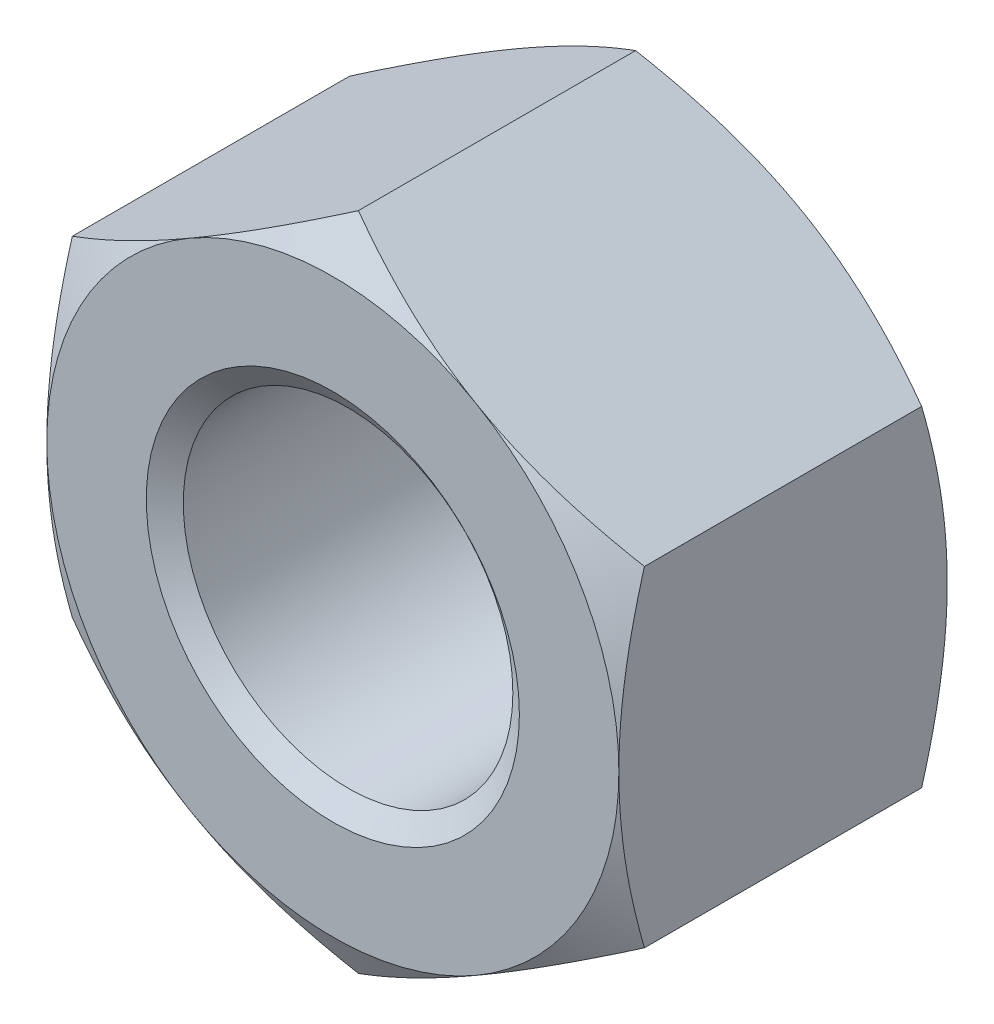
ISO-10303-21;
HEADER;
FILE_DESCRIPTION(('STEP AP214'),'2;1');
FILE_NAME('part.step','',(''),(''),'','','');
FILE_SCHEMA(('AUTOMOTIVE_DESIGN { 1 0 10303 214 1 1 1 1 }'));
ENDSEC;
DATA;
#1=APPLICATION_CONTEXT('core data for automotive mechanical design processes');
#2=APPLICATION_PROTOCOL_DEFINITION('international standard','automotive_design',2000,#1);
#3=PRODUCT_CONTEXT('',#1,'mechanical');
#4=PRODUCT('Part','Part','',(#3));
#5=PRODUCT_RELATED_PRODUCT_CATEGORY('part','',(#4));
#6=PRODUCT_DEFINITION_FORMATION('','',#4);
#7=PRODUCT_DEFINITION_CONTEXT('part definition',#1,'design');
#8=PRODUCT_DEFINITION('design','',#6,#7);
#9=PRODUCT_DEFINITION_SHAPE('','',#8);
#10=(LENGTH_UNIT() NAMED_UNIT(*) SI_UNIT(.MILLI.,.METRE.));
#11=(NAMED_UNIT(*) PLANE_ANGLE_UNIT() SI_UNIT($,.RADIAN.));
#12=(NAMED_UNIT(*) SI_UNIT($,.STERADIAN.) SOLID_ANGLE_UNIT());
#13=UNCERTAINTY_MEASURE_WITH_UNIT(LENGTH_MEASURE(1.E-05),#10,'distance_accuracy_value','');
#14=(GEOMETRIC_REPRESENTATION_CONTEXT(3) GLOBAL_UNCERTAINTY_ASSIGNED_CONTEXT((#13)) GLOBAL_UNIT_ASSIGNED_CONTEXT((#10,
#11,#12)) REPRESENTATION_CONTEXT('',''));
#15=CARTESIAN_POINT('',(0.,0.,0.));
#16=DIRECTION('',(0.,0.,1.));
#17=DIRECTION('',(1.,0.,0.));
#18=AXIS2_PLACEMENT_3D('',#15,#16,#17);
#19=CARTESIAN_POINT('',(0.,0.,-26.4));
#20=DIRECTION('',(0.,0.,1.));
#21=DIRECTION('',(1.,0.,0.));
#22=AXIS2_PLACEMENT_3D('',#19,#20,#21);
#23=CYLINDRICAL_SURFACE('',#22,13.25);
#24=CARTESIAN_POINT('',(0.,0.,-1.22536319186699));
#25=DIRECTION('',(0.,0.,1.));
#26=DIRECTION('',(1.,0.,0.));
#27=AXIS2_PLACEMENT_3D('',#24,#25,#26);
#28=CIRCLE('',#27,13.25);
#29=CARTESIAN_POINT('',(13.25,0.,-1.22536319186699));
#30=VERTEX_POINT('',#29);
#31=EDGE_CURVE('E174',#30,#30,#28,.F.);
#32=ORIENTED_EDGE('',*,*,#31,.F.);
#33=EDGE_LOOP('',(#32));
#34=FACE_BOUND('',#33,.T.);
#35=CARTESIAN_POINT('',(0.,0.,-25.149236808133));
#36=DIRECTION('',(0.,0.,-1.));
#37=DIRECTION('',(-1.,0.,0.));
#38=AXIS2_PLACEMENT_3D('',#35,#36,#37);
#39=CIRCLE('',#38,13.25);
#40=CARTESIAN_POINT('',(-13.25,0.,-25.149236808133));
#41=VERTEX_POINT('',#40);
#42=EDGE_CURVE('E39',#41,#41,#39,.F.);
#43=ORIENTED_EDGE('',*,*,#42,.F.);
#44=EDGE_LOOP('',(#43));
#45=FACE_BOUND('',#44,.T.);
#46=ADVANCED_FACE('F34',(#34,#45),#23,.F.);
#47=CARTESIAN_POINT('',(0.,26.5581123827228,-26.4));
#48=DIRECTION('',(-0.500000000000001,0.866025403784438,0.));
#49=DIRECTION('',(-0.866025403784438,-0.500000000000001,0.));
#50=AXIS2_PLACEMENT_3D('',#47,#48,#49);
#51=PLANE('',#50);
#52=DIRECTION('',(0.,0.,1.));
#53=VECTOR('',#52,1.);
#54=CARTESIAN_POINT('',(-23.,13.2790561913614,-26.4));
#55=LINE('',#54,#53);
#56=CARTESIAN_POINT('',(-23.,13.2790561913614,-24.345722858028));
#57=VERTEX_POINT('',#56);
#58=CARTESIAN_POINT('',(-23.,13.2790561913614,-2.05427714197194));
#59=VERTEX_POINT('',#58);
#60=EDGE_CURVE('E164',#57,#59,#55,.T.);
#61=ORIENTED_EDGE('',*,*,#60,.T.);
#62=CARTESIAN_POINT('',(-23.0002,13.2789407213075,-2.05434380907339));
#63=CARTESIAN_POINT('',(-22.4946699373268,13.5708086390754,-1.88584599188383));
#64=CARTESIAN_POINT('',(-21.9871680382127,13.8638149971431,-1.72499439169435));
#65=CARTESIAN_POINT('',(-20.9680946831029,14.4521772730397,-1.42070899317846));
#66=CARTESIAN_POINT('',(-20.4565219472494,14.7475339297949,-1.27728092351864));
#67=CARTESIAN_POINT('',(-19.4283073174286,15.3411739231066,-1.00976772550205));
#68=CARTESIAN_POINT('',(-18.9116563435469,15.6394625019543,-0.885728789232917));
#69=CARTESIAN_POINT('',(-17.874786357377,16.2380996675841,-0.659665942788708));
#70=CARTESIAN_POINT('',(-17.3545677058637,16.5384480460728,-0.557639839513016));
#71=CARTESIAN_POINT('',(-16.3238595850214,17.133527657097,-0.379933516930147));
#72=CARTESIAN_POINT('',(-15.8134465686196,17.4282147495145,-0.303665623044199));
#73=CARTESIAN_POINT('',(-14.7902817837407,18.0189392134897,-0.175781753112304));
#74=CARTESIAN_POINT('',(-14.2775299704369,18.3149766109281,-0.12416625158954));
#75=CARTESIAN_POINT('',(-13.2511650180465,18.9075486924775,-0.046890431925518));
#76=CARTESIAN_POINT('',(-12.737553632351,19.2040823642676,-0.021199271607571));
#77=CARTESIAN_POINT('',(-11.709856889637,19.7974233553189,0.00367538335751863));
#78=CARTESIAN_POINT('',(-11.1957715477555,20.0942306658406,0.00285969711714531));
#79=CARTESIAN_POINT('',(-10.2346805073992,20.649116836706,-0.0234279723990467));
#80=CARTESIAN_POINT('',(-9.78760635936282,20.9072352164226,-0.0456944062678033));
#81=CARTESIAN_POINT('',(-8.89452539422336,21.422855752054,-0.109851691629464));
#82=CARTESIAN_POINT('',(-8.448518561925,21.6803579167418,-0.151742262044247));
#83=CARTESIAN_POINT('',(-7.55773701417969,22.1946508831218,-0.254421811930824));
#84=CARTESIAN_POINT('',(-7.11296378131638,22.4514408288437,-0.315227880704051));
#85=CARTESIAN_POINT('',(-6.22554696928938,22.9637911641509,-0.454662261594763));
#86=CARTESIAN_POINT('',(-5.78290338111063,23.219351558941,-0.533290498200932));
#87=CARTESIAN_POINT('',(-4.43913170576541,23.9951784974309,-0.797926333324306));
#88=CARTESIAN_POINT('',(-3.54182151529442,24.513240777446,-1.01033549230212));
#89=CARTESIAN_POINT('',(-2.20576568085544,25.2846129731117,-1.37195212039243));
#90=CARTESIAN_POINT('',(-1.76244815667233,25.5405624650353,-1.49952801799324));
#91=CARTESIAN_POINT('',(-0.878879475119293,26.0506910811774,-1.76759530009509));
#92=CARTESIAN_POINT('',(-0.438627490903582,26.3048706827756,-1.90808304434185));
#93=CARTESIAN_POINT('',(0.000200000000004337,26.5582278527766,-2.05434380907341));
#94=B_SPLINE_CURVE_WITH_KNOTS('',3,(#62,#63,#64,#65,#66,#67,#68,#69,#70,#71,#72,#73,#74,#75,#76,
#77,#78,#79,#80,#81,#82,#83,#84,#85,#86,#87,#88,#89,#90,#91,#92,#93),.UNSPECIFIED.,.F.,.F.,(4,2,
2,2,2,2,2,2,2,2,2,2,2,2,2,4),(0.,1.82275209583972,3.64610187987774,5.47373144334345,
7.3011788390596,9.08355891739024,10.8659733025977,12.6462646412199,14.4265009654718,
15.9762768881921,17.5260306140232,19.0771885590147,20.6283399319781,23.7989683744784,
25.381520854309,26.9636285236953),.UNSPECIFIED.);
#95=CARTESIAN_POINT('',(-11.5,19.9185842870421,0.));
#96=VERTEX_POINT('',#95);
#97=EDGE_CURVE('E133',#59,#96,#94,.T.);
#98=ORIENTED_EDGE('',*,*,#97,.T.);
#99=CARTESIAN_POINT('',(0.,26.5581123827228,-2.05427714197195));
#100=VERTEX_POINT('',#99);
#101=EDGE_CURVE('E53',#96,#100,#94,.T.);
#102=ORIENTED_EDGE('',*,*,#101,.T.);
#103=DIRECTION('',(0.,0.,1.));
#104=VECTOR('',#103,1.);
#105=CARTESIAN_POINT('',(0.,26.5581123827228,-26.4));
#106=LINE('',#105,#104);
#107=CARTESIAN_POINT('',(0.,26.5581123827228,-24.345722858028));
#108=VERTEX_POINT('',#107);
#109=EDGE_CURVE('E149',#108,#100,#106,.T.);
#110=ORIENTED_EDGE('',*,*,#109,.F.);
#111=CARTESIAN_POINT('',(-23.0002,13.2789407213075,-24.3456561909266));
#112=CARTESIAN_POINT('',(-22.4946699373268,13.5708086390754,-24.5141540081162));
#113=CARTESIAN_POINT('',(-21.9871680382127,13.8638149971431,-24.6750056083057));
#114=CARTESIAN_POINT('',(-20.9680946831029,14.4521772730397,-24.9792910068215));
#115=CARTESIAN_POINT('',(-20.4565219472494,14.7475339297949,-25.1227190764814));
#116=CARTESIAN_POINT('',(-19.4283073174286,15.3411739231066,-25.3902322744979));
#117=CARTESIAN_POINT('',(-18.9116563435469,15.6394625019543,-25.5142712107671));
#118=CARTESIAN_POINT('',(-17.874786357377,16.2380996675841,-25.7403340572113));
#119=CARTESIAN_POINT('',(-17.3545677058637,16.5384480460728,-25.842360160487));
#120=CARTESIAN_POINT('',(-16.3238595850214,17.133527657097,-26.0200664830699));
#121=CARTESIAN_POINT('',(-15.8134465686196,17.4282147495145,-26.0963343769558));
#122=CARTESIAN_POINT('',(-14.7902817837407,18.0189392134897,-26.2242182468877));
#123=CARTESIAN_POINT('',(-14.2775299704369,18.3149766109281,-26.2758337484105));
#124=CARTESIAN_POINT('',(-13.2511650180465,18.9075486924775,-26.3531095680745));
#125=CARTESIAN_POINT('',(-12.737553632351,19.2040823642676,-26.3788007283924));
#126=CARTESIAN_POINT('',(-11.709856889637,19.7974233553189,-26.4036753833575));
#127=CARTESIAN_POINT('',(-11.1957715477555,20.0942306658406,-26.4028596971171));
#128=CARTESIAN_POINT('',(-10.2346805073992,20.649116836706,-26.376572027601));
#129=CARTESIAN_POINT('',(-9.78760635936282,20.9072352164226,-26.3543055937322));
#130=CARTESIAN_POINT('',(-8.89452539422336,21.422855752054,-26.2901483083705));
#131=CARTESIAN_POINT('',(-8.448518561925,21.6803579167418,-26.2482577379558));
#132=CARTESIAN_POINT('',(-7.55773701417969,22.1946508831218,-26.1455781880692));
#133=CARTESIAN_POINT('',(-7.11296378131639,22.4514408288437,-26.084772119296));
#134=CARTESIAN_POINT('',(-6.22554696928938,22.9637911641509,-25.9453377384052));
#135=CARTESIAN_POINT('',(-5.78290338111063,23.219351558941,-25.8667095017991));
#136=CARTESIAN_POINT('',(-4.43913170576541,23.9951784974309,-25.6020736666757));
#137=CARTESIAN_POINT('',(-3.54182151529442,24.513240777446,-25.3896645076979));
#138=CARTESIAN_POINT('',(-2.20576568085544,25.2846129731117,-25.0280478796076));
#139=CARTESIAN_POINT('',(-1.76244815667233,25.5405624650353,-24.9004719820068));
#140=CARTESIAN_POINT('',(-0.878879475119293,26.0506910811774,-24.6324046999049));
#141=CARTESIAN_POINT('',(-0.438627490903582,26.3048706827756,-24.4919169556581));
#142=CARTESIAN_POINT('',(0.000200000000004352,26.5582278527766,-24.3456561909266));
#143=B_SPLINE_CURVE_WITH_KNOTS('',3,(#111,#112,#113,#114,#115,#116,#117,#118,#119,#120,#121,
#122,#123,#124,#125,#126,#127,#128,#129,#130,#131,#132,#133,#134,#135,#136,#137,#138,#139,#140,
#141,#142),.UNSPECIFIED.,.F.,.F.,(4,2,2,2,2,2,2,2,2,2,2,2,2,2,2,4),(0.,1.82275209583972,
3.64610187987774,5.47373144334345,7.3011788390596,9.08355891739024,10.8659733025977,
12.6462646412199,14.4265009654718,15.9762768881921,17.5260306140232,19.0771885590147,
20.6283399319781,23.7989683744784,25.381520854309,26.9636285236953),.UNSPECIFIED.);
#144=CARTESIAN_POINT('',(-11.5,19.9185842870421,-26.4));
#145=VERTEX_POINT('',#144);
#146=EDGE_CURVE('E167',#145,#108,#143,.T.);
#147=ORIENTED_EDGE('',*,*,#146,.F.);
#148=EDGE_CURVE('E259',#57,#145,#143,.T.);
#149=ORIENTED_EDGE('',*,*,#148,.F.);
#150=EDGE_LOOP('',(#61,#98,#102,#110,#147,#149));
#151=FACE_BOUND('',#150,.T.);
#152=ADVANCED_FACE('F36',(#151),#51,.T.);
#153=CARTESIAN_POINT('',(23.,13.2790561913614,-26.4));
#154=DIRECTION('',(0.500000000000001,0.866025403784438,0.));
#155=DIRECTION('',(-0.866025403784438,0.500000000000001,0.));
#156=AXIS2_PLACEMENT_3D('',#153,#154,#155);
#157=PLANE('',#156);
#158=ORIENTED_EDGE('',*,*,#109,.T.);
#159=CARTESIAN_POINT('',(-0.000199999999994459,26.5582278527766,-2.05434380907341));
#160=CARTESIAN_POINT('',(0.505330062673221,26.2663599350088,-1.88584599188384));
#161=CARTESIAN_POINT('',(1.01283196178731,25.973353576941,-1.72499439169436));
#162=CARTESIAN_POINT('',(2.03190531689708,25.3849913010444,-1.42070899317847));
#163=CARTESIAN_POINT('',(2.54347805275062,25.0896346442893,-1.27728092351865));
#164=CARTESIAN_POINT('',(3.57169268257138,24.4959946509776,-1.00976772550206));
#165=CARTESIAN_POINT('',(4.08834365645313,24.1977060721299,-0.885728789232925));
#166=CARTESIAN_POINT('',(5.12521364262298,23.5990689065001,-0.659665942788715));
#167=CARTESIAN_POINT('',(5.64543229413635,23.2987205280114,-0.557639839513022));
#168=CARTESIAN_POINT('',(6.67614041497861,22.7036409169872,-0.379933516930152));
#169=CARTESIAN_POINT('',(7.18655343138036,22.4089538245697,-0.303665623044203));
#170=CARTESIAN_POINT('',(8.20971821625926,21.8182293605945,-0.175781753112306));
#171=CARTESIAN_POINT('',(8.72247002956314,21.5221919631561,-0.124166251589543));
#172=CARTESIAN_POINT('',(9.74883498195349,20.9296198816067,-0.0468904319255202));
#173=CARTESIAN_POINT('',(10.262446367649,20.6330862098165,-0.0211992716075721));
#174=CARTESIAN_POINT('',(11.2901431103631,20.0397452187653,0.00367538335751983));
#175=CARTESIAN_POINT('',(11.8042284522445,19.7429379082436,0.00285969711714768));
#176=CARTESIAN_POINT('',(12.7653194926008,19.1880517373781,-0.0234279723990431));
#177=CARTESIAN_POINT('',(13.2123936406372,18.9299333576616,-0.0456944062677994));
#178=CARTESIAN_POINT('',(14.1054746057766,18.4143128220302,-0.10985169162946));
#179=CARTESIAN_POINT('',(14.551481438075,18.1568106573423,-0.151742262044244));
#180=CARTESIAN_POINT('',(15.4422629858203,17.6425176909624,-0.25442181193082));
#181=CARTESIAN_POINT('',(15.8870362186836,17.3857277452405,-0.315227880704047));
#182=CARTESIAN_POINT('',(16.7744530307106,16.8733774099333,-0.454662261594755));
#183=CARTESIAN_POINT('',(17.2170966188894,16.6178170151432,-0.533290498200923));
#184=CARTESIAN_POINT('',(18.5608682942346,15.8419900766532,-0.797926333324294));
#185=CARTESIAN_POINT('',(19.4581784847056,15.3239277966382,-1.01033549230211));
#186=CARTESIAN_POINT('',(20.7942343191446,14.5525556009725,-1.37195212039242));
#187=CARTESIAN_POINT('',(21.2375518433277,14.2966061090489,-1.49952801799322));
#188=CARTESIAN_POINT('',(22.1211205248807,13.7864774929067,-1.76759530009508));
#189=CARTESIAN_POINT('',(22.5613725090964,13.5322978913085,-1.90808304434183));
#190=CARTESIAN_POINT('',(23.0002,13.2789407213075,-2.05434380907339));
#191=B_SPLINE_CURVE_WITH_KNOTS('',3,(#159,#160,#161,#162,#163,#164,#165,#166,#167,#168,#169,
#170,#171,#172,#173,#174,#175,#176,#177,#178,#179,#180,#181,#182,#183,#184,#185,#186,#187,#188,
#189,#190),.UNSPECIFIED.,.F.,.F.,(4,2,2,2,2,2,2,2,2,2,2,2,2,2,2,4),(0.,1.82275209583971,
3.64610187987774,5.47373144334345,7.3011788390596,9.08355891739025,10.8659733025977,
12.6462646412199,14.4265009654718,15.9762768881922,17.5260306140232,19.0771885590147,
20.6283399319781,23.7989683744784,25.381520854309,26.9636285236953),.UNSPECIFIED.);
#192=CARTESIAN_POINT('',(11.5,19.9185842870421,0.));
#193=VERTEX_POINT('',#192);
#194=EDGE_CURVE('E143',#100,#193,#191,.T.);
#195=ORIENTED_EDGE('',*,*,#194,.T.);
#196=CARTESIAN_POINT('',(23.,13.2790561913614,-2.05427714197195));
#197=VERTEX_POINT('',#196);
#198=EDGE_CURVE('E60',#193,#197,#191,.T.);
#199=ORIENTED_EDGE('',*,*,#198,.T.);
#200=DIRECTION('',(0.,0.,1.));
#201=VECTOR('',#200,1.);
#202=CARTESIAN_POINT('',(23.,13.2790561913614,-26.4));
#203=LINE('',#202,#201);
#204=CARTESIAN_POINT('',(23.,13.2790561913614,-24.345722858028));
#205=VERTEX_POINT('',#204);
#206=EDGE_CURVE('E142',#205,#197,#203,.T.);
#207=ORIENTED_EDGE('',*,*,#206,.F.);
#208=CARTESIAN_POINT('',(-0.000199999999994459,26.5582278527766,-24.3456561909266));
#209=CARTESIAN_POINT('',(0.505330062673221,26.2663599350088,-24.5141540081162));
#210=CARTESIAN_POINT('',(1.01283196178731,25.973353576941,-24.6750056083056));
#211=CARTESIAN_POINT('',(2.03190531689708,25.3849913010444,-24.9792910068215));
#212=CARTESIAN_POINT('',(2.54347805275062,25.0896346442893,-25.1227190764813));
#213=CARTESIAN_POINT('',(3.57169268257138,24.4959946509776,-25.3902322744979));
#214=CARTESIAN_POINT('',(4.08834365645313,24.1977060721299,-25.5142712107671));
#215=CARTESIAN_POINT('',(5.12521364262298,23.5990689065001,-25.7403340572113));
#216=CARTESIAN_POINT('',(5.64543229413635,23.2987205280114,-25.842360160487));
#217=CARTESIAN_POINT('',(6.67614041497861,22.7036409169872,-26.0200664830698));
#218=CARTESIAN_POINT('',(7.18655343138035,22.4089538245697,-26.0963343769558));
#219=CARTESIAN_POINT('',(8.20971821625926,21.8182293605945,-26.2242182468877));
#220=CARTESIAN_POINT('',(8.72247002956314,21.5221919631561,-26.2758337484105));
#221=CARTESIAN_POINT('',(9.74883498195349,20.9296198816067,-26.3531095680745));
#222=CARTESIAN_POINT('',(10.262446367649,20.6330862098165,-26.3788007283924));
#223=CARTESIAN_POINT('',(11.2901431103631,20.0397452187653,-26.4036753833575));
#224=CARTESIAN_POINT('',(11.8042284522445,19.7429379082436,-26.4028596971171));
#225=CARTESIAN_POINT('',(12.7653194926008,19.1880517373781,-26.376572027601));
#226=CARTESIAN_POINT('',(13.2123936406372,18.9299333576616,-26.3543055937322));
#227=CARTESIAN_POINT('',(14.1054746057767,18.4143128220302,-26.2901483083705));
#228=CARTESIAN_POINT('',(14.551481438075,18.1568106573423,-26.2482577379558));
#229=CARTESIAN_POINT('',(15.4422629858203,17.6425176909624,-26.1455781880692));
#230=CARTESIAN_POINT('',(15.8870362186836,17.3857277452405,-26.084772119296));
#231=CARTESIAN_POINT('',(16.7744530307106,16.8733774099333,-25.9453377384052));
#232=CARTESIAN_POINT('',(17.2170966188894,16.6178170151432,-25.8667095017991));
#233=CARTESIAN_POINT('',(18.5608682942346,15.8419900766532,-25.6020736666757));
#234=CARTESIAN_POINT('',(19.4581784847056,15.3239277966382,-25.3896645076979));
#235=CARTESIAN_POINT('',(20.7942343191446,14.5525556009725,-25.0280478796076));
#236=CARTESIAN_POINT('',(21.2375518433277,14.2966061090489,-24.9004719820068));
#237=CARTESIAN_POINT('',(22.1211205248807,13.7864774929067,-24.6324046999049));
#238=CARTESIAN_POINT('',(22.5613725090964,13.5322978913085,-24.4919169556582));
#239=CARTESIAN_POINT('',(23.0002,13.2789407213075,-24.3456561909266));
#240=B_SPLINE_CURVE_WITH_KNOTS('',3,(#208,#209,#210,#211,#212,#213,#214,#215,#216,#217,#218,
#219,#220,#221,#222,#223,#224,#225,#226,#227,#228,#229,#230,#231,#232,#233,#234,#235,#236,#237,
#238,#239),.UNSPECIFIED.,.F.,.F.,(4,2,2,2,2,2,2,2,2,2,2,2,2,2,2,4),(0.,1.82275209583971,
3.64610187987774,5.47373144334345,7.3011788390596,9.08355891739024,10.8659733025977,
12.6462646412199,14.4265009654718,15.9762768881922,17.5260306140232,19.0771885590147,
20.6283399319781,23.7989683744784,25.381520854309,26.9636285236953),.UNSPECIFIED.);
#241=CARTESIAN_POINT('',(11.5,19.9185842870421,-26.4));
#242=VERTEX_POINT('',#241);
#243=EDGE_CURVE('E253',#242,#205,#240,.T.);
#244=ORIENTED_EDGE('',*,*,#243,.F.);
#245=EDGE_CURVE('E258',#108,#242,#240,.T.);
#246=ORIENTED_EDGE('',*,*,#245,.F.);
#247=EDGE_LOOP('',(#158,#195,#199,#207,#244,#246));
#248=FACE_BOUND('',#247,.T.);
#249=ADVANCED_FACE('F140',(#248),#157,.T.);
#250=CARTESIAN_POINT('',(23.,13.2790561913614,-26.4));
#251=DIRECTION('',(-1.,0.,0.));
#252=DIRECTION('',(0.,0.,1.));
#253=AXIS2_PLACEMENT_3D('',#250,#251,#252);
#254=PLANE('',#253);
#255=CARTESIAN_POINT('',(23.,-35.2180139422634,-11.0061142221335));
#256=CARTESIAN_POINT('',(23.,-34.7131179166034,-10.7620572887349));
#257=CARTESIAN_POINT('',(23.,-34.2076112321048,-10.5192598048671));
#258=CARTESIAN_POINT('',(23.,-33.1952483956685,-10.0364809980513));
#259=CARTESIAN_POINT('',(23.,-32.6883922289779,-9.79649970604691));
#260=CARTESIAN_POINT('',(23.,-31.6731272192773,-9.31961545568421));
#261=CARTESIAN_POINT('',(23.,-31.1647181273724,-9.08271302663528));
#262=CARTESIAN_POINT('',(23.,-30.1462960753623,-8.61238713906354));
#263=CARTESIAN_POINT('',(23.,-29.6362831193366,-8.37896367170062));
#264=CARTESIAN_POINT('',(23.,-28.0977616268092,-7.68184178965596));
#265=CARTESIAN_POINT('',(23.,-27.0665726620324,-7.22402785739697));
#266=CARTESIAN_POINT('',(23.,-24.9957268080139,-6.32805391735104));
#267=CARTESIAN_POINT('',(23.,-23.9560703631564,-5.8898928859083));
#268=CARTESIAN_POINT('',(23.,-21.8537217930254,-5.03326545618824));
#269=CARTESIAN_POINT('',(23.,-20.7909035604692,-4.61510688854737));
#270=CARTESIAN_POINT('',(23.,-18.6527242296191,-3.81153823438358));
#271=CARTESIAN_POINT('',(23.,-17.577361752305,-3.42613178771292));
#272=CARTESIAN_POINT('',(23.,-15.4146266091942,-2.69842857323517));
#273=CARTESIAN_POINT('',(23.,-14.327285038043,-2.35604014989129));
#274=CARTESIAN_POINT('',(23.,-12.1370388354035,-1.72547560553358));
#275=CARTESIAN_POINT('',(23.,-11.0341392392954,-1.4372823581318));
#276=CARTESIAN_POINT('',(23.,-9.36791170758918,-1.05618881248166));
#277=CARTESIAN_POINT('',(23.,-8.81040454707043,-0.937670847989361));
#278=CARTESIAN_POINT('',(23.,-7.69167970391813,-0.71957183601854));
#279=CARTESIAN_POINT('',(23.,-7.13046210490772,-0.619990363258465));
#280=CARTESIAN_POINT('',(23.,-6.00469304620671,-0.44152976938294));
#281=CARTESIAN_POINT('',(23.,-5.44014138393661,-0.362651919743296));
#282=CARTESIAN_POINT('',(23.,-4.3083510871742,-0.227182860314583));
#283=CARTESIAN_POINT('',(23.,-3.74111244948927,-0.17059167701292));
#284=CARTESIAN_POINT('',(23.,-2.60837639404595,-0.0812194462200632));
#285=CARTESIAN_POINT('',(23.,-2.04289080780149,-0.048289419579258));
#286=CARTESIAN_POINT('',(23.,-0.911034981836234,-0.006412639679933));
#287=CARTESIAN_POINT('',(23.,-0.344664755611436,0.00253447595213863));
#288=CARTESIAN_POINT('',(23.,0.787786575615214,-0.00376669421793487));
#289=CARTESIAN_POINT('',(23.,1.35386771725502,-0.0190082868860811));
#290=CARTESIAN_POINT('',(23.,2.48489076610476,-0.073308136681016));
#291=CARTESIAN_POINT('',(23.,3.0498326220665,-0.112367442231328));
#292=CARTESIAN_POINT('',(23.,4.41865655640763,-0.235046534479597));
#293=CARTESIAN_POINT('',(23.,5.22148876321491,-0.330575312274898));
#294=CARTESIAN_POINT('',(23.,6.82090570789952,-0.564419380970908));
#295=CARTESIAN_POINT('',(23.,7.61748950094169,-0.702741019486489));
#296=CARTESIAN_POINT('',(23.,9.20481563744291,-1.01746542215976));
#297=CARTESIAN_POINT('',(23.,9.99554164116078,-1.19394981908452));
#298=CARTESIAN_POINT('',(23.,11.568898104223,-1.57951953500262));
#299=CARTESIAN_POINT('',(23.,12.3515288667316,-1.78860362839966));
#300=CARTESIAN_POINT('',(23.,13.9271257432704,-2.23959590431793));
#301=CARTESIAN_POINT('',(23.,14.7199029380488,-2.48215963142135));
#302=CARTESIAN_POINT('',(23.,16.2976906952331,-2.99143683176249));
#303=CARTESIAN_POINT('',(23.,17.0827005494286,-3.25815248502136));
#304=CARTESIAN_POINT('',(23.,18.6411786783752,-3.81009153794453));
#305=CARTESIAN_POINT('',(23.,19.4146870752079,-4.09520208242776));
#306=CARTESIAN_POINT('',(23.,20.5700723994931,-4.53521033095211));
#307=CARTESIAN_POINT('',(23.,20.9543266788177,-4.68391196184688));
#308=CARTESIAN_POINT('',(23.,21.7213392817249,-4.98509471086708));
#309=CARTESIAN_POINT('',(23.,22.1040976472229,-5.13757572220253));
#310=CARTESIAN_POINT('',(23.,22.4861626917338,-5.29177678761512));
#311=B_SPLINE_CURVE_WITH_KNOTS('',3,(#255,#256,#257,#258,#259,#260,#261,#262,#263,#264,#265,
#266,#267,#268,#269,#270,#271,#272,#273,#274,#275,#276,#277,#278,#279,#280,#281,#282,#283,#284,
#285,#286,#287,#288,#289,#290,#291,#292,#293,#294,#295,#296,#297,#298,#299,#300,#301,#302,#303,
#304,#305,#306,#307,#308,#309,#310),.UNSPECIFIED.,.F.,.F.,(4,2,2,2,2,2,2,2,2,2,2,2,2,2,2,2,2,2,
2,2,2,2,2,2,2,2,2,4),(0.,1.68236622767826,3.36475092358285,5.0474211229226,6.73008704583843,
10.1146618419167,13.4990601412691,16.9250084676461,20.3513370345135,23.7702368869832,
27.1880544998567,28.897681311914,30.6072697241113,32.3169631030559,34.0266585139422,
35.7254924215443,37.4243006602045,39.1226389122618,40.8210519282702,43.245189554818,
45.669686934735,48.099422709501,50.5290671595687,53.0157707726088,55.5026990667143,
57.9756025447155,59.2116575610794,60.4476776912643),.UNSPECIFIED.);
#312=CARTESIAN_POINT('',(23.,-13.2790561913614,-2.05427714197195));
#313=VERTEX_POINT('',#312);
#314=CARTESIAN_POINT('',(23.,0.,0.));
#315=VERTEX_POINT('',#314);
#316=EDGE_CURVE('E135',#313,#315,#311,.T.);
#317=ORIENTED_EDGE('',*,*,#316,.F.);
#318=DIRECTION('',(0.,0.,1.));
#319=VECTOR('',#318,1.);
#320=CARTESIAN_POINT('',(23.,-13.2790561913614,-26.4));
#321=LINE('',#320,#319);
#322=CARTESIAN_POINT('',(23.,-13.2790561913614,-24.345722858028));
#323=VERTEX_POINT('',#322);
#324=EDGE_CURVE('E150',#323,#313,#321,.T.);
#325=ORIENTED_EDGE('',*,*,#324,.F.);
#326=CARTESIAN_POINT('',(23.,-35.2180139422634,-15.3938857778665));
#327=CARTESIAN_POINT('',(23.,-34.7131179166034,-15.6379427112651));
#328=CARTESIAN_POINT('',(23.,-34.2076112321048,-15.8807401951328));
#329=CARTESIAN_POINT('',(23.,-33.1952483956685,-16.3635190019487));
#330=CARTESIAN_POINT('',(23.,-32.6883922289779,-16.6035002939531));
#331=CARTESIAN_POINT('',(23.,-31.6731272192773,-17.0803845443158));
#332=CARTESIAN_POINT('',(23.,-31.1647181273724,-17.3172869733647));
#333=CARTESIAN_POINT('',(23.,-30.1462960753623,-17.7876128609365));
#334=CARTESIAN_POINT('',(23.,-29.6362831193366,-18.0210363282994));
#335=CARTESIAN_POINT('',(23.,-28.0977616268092,-18.718158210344));
#336=CARTESIAN_POINT('',(23.,-27.0665726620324,-19.175972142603));
#337=CARTESIAN_POINT('',(23.,-24.9957268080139,-20.071946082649));
#338=CARTESIAN_POINT('',(23.,-23.9560703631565,-20.5101071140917));
#339=CARTESIAN_POINT('',(23.,-21.8537217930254,-21.3667345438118));
#340=CARTESIAN_POINT('',(23.,-20.7909035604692,-21.7848931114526));
#341=CARTESIAN_POINT('',(23.,-18.6527242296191,-22.5884617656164));
#342=CARTESIAN_POINT('',(23.,-17.577361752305,-22.9738682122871));
#343=CARTESIAN_POINT('',(23.,-15.4146266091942,-23.7015714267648));
#344=CARTESIAN_POINT('',(23.,-14.327285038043,-24.0439598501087));
#345=CARTESIAN_POINT('',(23.,-12.1370388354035,-24.6745243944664));
#346=CARTESIAN_POINT('',(23.,-11.0341392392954,-24.9627176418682));
#347=CARTESIAN_POINT('',(23.,-9.36791170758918,-25.3438111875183));
#348=CARTESIAN_POINT('',(23.,-8.81040454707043,-25.4623291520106));
#349=CARTESIAN_POINT('',(23.,-7.69167970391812,-25.6804281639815));
#350=CARTESIAN_POINT('',(23.,-7.13046210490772,-25.7800096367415));
#351=CARTESIAN_POINT('',(23.,-6.0046930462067,-25.9584702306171));
#352=CARTESIAN_POINT('',(23.,-5.4401413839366,-26.0373480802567));
#353=CARTESIAN_POINT('',(23.,-4.30835108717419,-26.1728171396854));
#354=CARTESIAN_POINT('',(23.,-3.74111244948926,-26.2294083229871));
#355=CARTESIAN_POINT('',(23.,-2.60837639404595,-26.3187805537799));
#356=CARTESIAN_POINT('',(23.,-2.04289080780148,-26.3517105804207));
#357=CARTESIAN_POINT('',(23.,-0.911034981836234,-26.3935873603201));
#358=CARTESIAN_POINT('',(23.,-0.344664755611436,-26.4025344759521));
#359=CARTESIAN_POINT('',(23.,0.787786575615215,-26.3962333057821));
#360=CARTESIAN_POINT('',(23.,1.35386771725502,-26.3809917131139));
#361=CARTESIAN_POINT('',(23.,2.48489076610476,-26.326691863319));
#362=CARTESIAN_POINT('',(23.,3.0498326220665,-26.2876325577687));
#363=CARTESIAN_POINT('',(23.,4.41865655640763,-26.1649534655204));
#364=CARTESIAN_POINT('',(23.,5.22148876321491,-26.0694246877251));
#365=CARTESIAN_POINT('',(23.,6.82090570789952,-25.8355806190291));
#366=CARTESIAN_POINT('',(23.,7.61748950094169,-25.6972589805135));
#367=CARTESIAN_POINT('',(23.,9.20481563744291,-25.3825345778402));
#368=CARTESIAN_POINT('',(23.,9.99554164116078,-25.2060501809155));
#369=CARTESIAN_POINT('',(23.,11.568898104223,-24.8204804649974));
#370=CARTESIAN_POINT('',(23.,12.3515288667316,-24.6113963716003));
#371=CARTESIAN_POINT('',(23.,13.9271257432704,-24.1604040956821));
#372=CARTESIAN_POINT('',(23.,14.7199029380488,-23.9178403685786));
#373=CARTESIAN_POINT('',(23.,16.2976906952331,-23.4085631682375));
#374=CARTESIAN_POINT('',(23.,17.0827005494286,-23.1418475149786));
#375=CARTESIAN_POINT('',(23.,18.6411786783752,-22.5899084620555));
#376=CARTESIAN_POINT('',(23.,19.4146870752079,-22.3047979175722));
#377=CARTESIAN_POINT('',(23.,20.5700723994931,-21.8647896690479));
#378=CARTESIAN_POINT('',(23.,20.9543266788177,-21.7160880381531));
#379=CARTESIAN_POINT('',(23.,21.7213392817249,-21.4149052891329));
#380=CARTESIAN_POINT('',(23.,22.1040976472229,-21.2624242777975));
#381=CARTESIAN_POINT('',(23.,22.4861626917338,-21.1082232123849));
#382=B_SPLINE_CURVE_WITH_KNOTS('',3,(#326,#327,#328,#329,#330,#331,#332,#333,#334,#335,#336,
#337,#338,#339,#340,#341,#342,#343,#344,#345,#346,#347,#348,#349,#350,#351,#352,#353,#354,#355,
#356,#357,#358,#359,#360,#361,#362,#363,#364,#365,#366,#367,#368,#369,#370,#371,#372,#373,#374,
#375,#376,#377,#378,#379,#380,#381),.UNSPECIFIED.,.F.,.F.,(4,2,2,2,2,2,2,2,2,2,2,2,2,2,2,2,2,2,
2,2,2,2,2,2,2,2,2,4),(0.,1.68236622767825,3.36475092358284,5.0474211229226,6.73008704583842,
10.1146618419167,13.4990601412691,16.925008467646,20.3513370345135,23.7702368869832,
27.1880544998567,28.897681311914,30.6072697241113,32.3169631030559,34.0266585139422,
35.7254924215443,37.4243006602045,39.1226389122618,40.8210519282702,43.2451895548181,
45.669686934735,48.0994227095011,50.5290671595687,53.0157707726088,55.5026990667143,
57.9756025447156,59.2116575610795,60.4476776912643),.UNSPECIFIED.);
#383=CARTESIAN_POINT('',(23.,0.,-26.4));
#384=VERTEX_POINT('',#383);
#385=EDGE_CURVE('E265',#323,#384,#382,.T.);
#386=ORIENTED_EDGE('',*,*,#385,.T.);
#387=EDGE_CURVE('E148',#384,#205,#382,.T.);
#388=ORIENTED_EDGE('',*,*,#387,.T.);
#389=ORIENTED_EDGE('',*,*,#206,.T.);
#390=EDGE_CURVE('E125',#315,#197,#311,.T.);
#391=ORIENTED_EDGE('',*,*,#390,.F.);
#392=EDGE_LOOP('',(#317,#325,#386,#388,#389,#391));
#393=FACE_BOUND('',#392,.T.);
#394=ADVANCED_FACE('F146',(#393),#254,.F.);
#395=CARTESIAN_POINT('',(0.,-26.5581123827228,-26.4));
#396=DIRECTION('',(0.5,-0.866025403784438,0.));
#397=DIRECTION('',(0.866025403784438,0.5,0.));
#398=AXIS2_PLACEMENT_3D('',#395,#396,#397);
#399=PLANE('',#398);
#400=ORIENTED_EDGE('',*,*,#324,.T.);
#401=CARTESIAN_POINT('',(23.0002,-13.2789407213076,-2.05434380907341));
#402=CARTESIAN_POINT('',(22.4946699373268,-13.5708086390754,-1.88584599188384));
#403=CARTESIAN_POINT('',(21.9871680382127,-13.8638149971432,-1.72499439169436));
#404=CARTESIAN_POINT('',(20.9680946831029,-14.4521772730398,-1.42070899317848));
#405=CARTESIAN_POINT('',(20.4565219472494,-14.7475339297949,-1.27728092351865));
#406=CARTESIAN_POINT('',(19.4283073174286,-15.3411739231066,-1.00976772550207));
#407=CARTESIAN_POINT('',(18.9116563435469,-15.6394625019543,-0.885728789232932));
#408=CARTESIAN_POINT('',(17.874786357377,-16.2380996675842,-0.659665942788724));
#409=CARTESIAN_POINT('',(17.3545677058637,-16.5384480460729,-0.557639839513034));
#410=CARTESIAN_POINT('',(16.3238595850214,-17.1335276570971,-0.379933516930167));
#411=CARTESIAN_POINT('',(15.8134465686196,-17.4282147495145,-0.303665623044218));
#412=CARTESIAN_POINT('',(14.7902817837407,-18.0189392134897,-0.175781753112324));
#413=CARTESIAN_POINT('',(14.2775299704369,-18.3149766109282,-0.124166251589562));
#414=CARTESIAN_POINT('',(13.2511650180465,-18.9075486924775,-0.0468904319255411));
#415=CARTESIAN_POINT('',(12.737553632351,-19.2040823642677,-0.021199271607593));
#416=CARTESIAN_POINT('',(11.7098568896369,-19.7974233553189,0.00367538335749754));
#417=CARTESIAN_POINT('',(11.1957715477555,-20.0942306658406,0.00285969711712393));
#418=CARTESIAN_POINT('',(10.2346805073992,-20.6491168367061,-0.0234279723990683));
#419=CARTESIAN_POINT('',(9.78760635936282,-20.9072352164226,-0.0456944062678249));
#420=CARTESIAN_POINT('',(8.89452539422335,-21.422855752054,-0.109851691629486));
#421=CARTESIAN_POINT('',(8.448518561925,-21.6803579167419,-0.151742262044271));
#422=CARTESIAN_POINT('',(7.55773701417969,-22.1946508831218,-0.254421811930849));
#423=CARTESIAN_POINT('',(7.11296378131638,-22.4514408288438,-0.315227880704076));
#424=CARTESIAN_POINT('',(6.22554696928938,-22.963791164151,-0.454662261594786));
#425=CARTESIAN_POINT('',(5.78290338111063,-23.219351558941,-0.533290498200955));
#426=CARTESIAN_POINT('',(4.43913170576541,-23.995178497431,-0.797926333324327));
#427=CARTESIAN_POINT('',(3.54182151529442,-24.513240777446,-1.01033549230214));
#428=CARTESIAN_POINT('',(2.20576568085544,-25.2846129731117,-1.37195212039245));
#429=CARTESIAN_POINT('',(1.76244815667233,-25.5405624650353,-1.49952801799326));
#430=CARTESIAN_POINT('',(0.878879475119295,-26.0506910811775,-1.76759530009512));
#431=CARTESIAN_POINT('',(0.438627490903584,-26.3048706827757,-1.90808304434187));
#432=CARTESIAN_POINT('',(-0.000200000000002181,-26.5582278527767,-2.05434380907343));
#433=B_SPLINE_CURVE_WITH_KNOTS('',3,(#401,#402,#403,#404,#405,#406,#407,#408,#409,#410,#411,
#412,#413,#414,#415,#416,#417,#418,#419,#420,#421,#422,#423,#424,#425,#426,#427,#428,#429,#430,
#431,#432),.UNSPECIFIED.,.F.,.F.,(4,2,2,2,2,2,2,2,2,2,2,2,2,2,2,4),(0.,1.82275209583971,
3.64610187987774,5.47373144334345,7.3011788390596,9.08355891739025,10.8659733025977,
12.6462646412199,14.4265009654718,15.9762768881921,17.5260306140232,19.0771885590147,
20.6283399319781,23.7989683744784,25.381520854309,26.9636285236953),.UNSPECIFIED.);
#434=CARTESIAN_POINT('',(11.5,-19.9185842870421,0.));
#435=VERTEX_POINT('',#434);
#436=EDGE_CURVE('E359',#313,#435,#433,.T.);
#437=ORIENTED_EDGE('',*,*,#436,.T.);
#438=CARTESIAN_POINT('',(0.,-26.5581123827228,-2.05427714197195));
#439=VERTEX_POINT('',#438);
#440=EDGE_CURVE('E225',#435,#439,#433,.T.);
#441=ORIENTED_EDGE('',*,*,#440,.T.);
#442=DIRECTION('',(0.,0.,1.));
#443=VECTOR('',#442,1.);
#444=CARTESIAN_POINT('',(0.,-26.5581123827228,-26.4));
#445=LINE('',#444,#443);
#446=CARTESIAN_POINT('',(0.,-26.5581123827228,-24.345722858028));
#447=VERTEX_POINT('',#446);
#448=EDGE_CURVE('E155',#447,#439,#445,.T.);
#449=ORIENTED_EDGE('',*,*,#448,.F.);
#450=CARTESIAN_POINT('',(23.0002,-13.2789407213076,-24.3456561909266));
#451=CARTESIAN_POINT('',(22.4946699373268,-13.5708086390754,-24.5141540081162));
#452=CARTESIAN_POINT('',(21.9871680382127,-13.8638149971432,-24.6750056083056));
#453=CARTESIAN_POINT('',(20.9680946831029,-14.4521772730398,-24.9792910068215));
#454=CARTESIAN_POINT('',(20.4565219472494,-14.7475339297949,-25.1227190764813));
#455=CARTESIAN_POINT('',(19.4283073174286,-15.3411739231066,-25.3902322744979));
#456=CARTESIAN_POINT('',(18.9116563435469,-15.6394625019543,-25.5142712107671));
#457=CARTESIAN_POINT('',(17.874786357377,-16.2380996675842,-25.7403340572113));
#458=CARTESIAN_POINT('',(17.3545677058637,-16.5384480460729,-25.842360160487));
#459=CARTESIAN_POINT('',(16.3238595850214,-17.1335276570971,-26.0200664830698));
#460=CARTESIAN_POINT('',(15.8134465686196,-17.4282147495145,-26.0963343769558));
#461=CARTESIAN_POINT('',(14.7902817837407,-18.0189392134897,-26.2242182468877));
#462=CARTESIAN_POINT('',(14.2775299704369,-18.3149766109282,-26.2758337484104));
#463=CARTESIAN_POINT('',(13.2511650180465,-18.9075486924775,-26.3531095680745));
#464=CARTESIAN_POINT('',(12.737553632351,-19.2040823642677,-26.3788007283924));
#465=CARTESIAN_POINT('',(11.7098568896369,-19.7974233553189,-26.4036753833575));
#466=CARTESIAN_POINT('',(11.1957715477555,-20.0942306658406,-26.4028596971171));
#467=CARTESIAN_POINT('',(10.2346805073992,-20.6491168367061,-26.3765720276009));
#468=CARTESIAN_POINT('',(9.78760635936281,-20.9072352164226,-26.3543055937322));
#469=CARTESIAN_POINT('',(8.89452539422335,-21.422855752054,-26.2901483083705));
#470=CARTESIAN_POINT('',(8.448518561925,-21.6803579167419,-26.2482577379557));
#471=CARTESIAN_POINT('',(7.55773701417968,-22.1946508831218,-26.1455781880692));
#472=CARTESIAN_POINT('',(7.11296378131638,-22.4514408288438,-26.0847721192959));
#473=CARTESIAN_POINT('',(6.22554696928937,-22.963791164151,-25.9453377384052));
#474=CARTESIAN_POINT('',(5.78290338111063,-23.219351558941,-25.866709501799));
#475=CARTESIAN_POINT('',(4.4391317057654,-23.995178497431,-25.6020736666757));
#476=CARTESIAN_POINT('',(3.54182151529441,-24.513240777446,-25.3896645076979));
#477=CARTESIAN_POINT('',(2.20576568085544,-25.2846129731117,-25.0280478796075));
#478=CARTESIAN_POINT('',(1.76244815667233,-25.5405624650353,-24.9004719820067));
#479=CARTESIAN_POINT('',(0.878879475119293,-26.0506910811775,-24.6324046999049));
#480=CARTESIAN_POINT('',(0.438627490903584,-26.3048706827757,-24.4919169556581));
#481=CARTESIAN_POINT('',(-0.000200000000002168,-26.5582278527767,-24.3456561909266));
#482=B_SPLINE_CURVE_WITH_KNOTS('',3,(#450,#451,#452,#453,#454,#455,#456,#457,#458,#459,#460,
#461,#462,#463,#464,#465,#466,#467,#468,#469,#470,#471,#472,#473,#474,#475,#476,#477,#478,#479,
#480,#481),.UNSPECIFIED.,.F.,.F.,(4,2,2,2,2,2,2,2,2,2,2,2,2,2,2,4),(0.,1.82275209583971,
3.64610187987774,5.47373144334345,7.3011788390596,9.08355891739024,10.8659733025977,
12.6462646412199,14.4265009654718,15.9762768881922,17.5260306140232,19.0771885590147,
20.6283399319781,23.7989683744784,25.381520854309,26.9636285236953),.UNSPECIFIED.);
#483=CARTESIAN_POINT('',(11.5,-19.9185842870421,-26.4));
#484=VERTEX_POINT('',#483);
#485=EDGE_CURVE('E271',#484,#447,#482,.T.);
#486=ORIENTED_EDGE('',*,*,#485,.F.);
#487=EDGE_CURVE('E270',#323,#484,#482,.T.);
#488=ORIENTED_EDGE('',*,*,#487,.F.);
#489=EDGE_LOOP('',(#400,#437,#441,#449,#486,#488));
#490=FACE_BOUND('',#489,.T.);
#491=ADVANCED_FACE('F281',(#490),#399,.T.);
#492=CARTESIAN_POINT('',(-23.,-13.2790561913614,-26.4));
#493=DIRECTION('',(-0.500000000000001,-0.866025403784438,0.));
#494=DIRECTION('',(0.866025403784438,-0.500000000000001,0.));
#495=AXIS2_PLACEMENT_3D('',#492,#493,#494);
#496=PLANE('',#495);
#497=ORIENTED_EDGE('',*,*,#448,.T.);
#498=CARTESIAN_POINT('',(0.000199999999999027,-26.5582278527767,-2.05434380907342));
#499=CARTESIAN_POINT('',(-0.505330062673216,-26.2663599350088,-1.88584599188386));
#500=CARTESIAN_POINT('',(-1.01283196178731,-25.9733535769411,-1.72499439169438));
#501=CARTESIAN_POINT('',(-2.03190531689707,-25.3849913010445,-1.42070899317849));
#502=CARTESIAN_POINT('',(-2.54347805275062,-25.0896346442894,-1.27728092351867));
#503=CARTESIAN_POINT('',(-3.57169268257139,-24.4959946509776,-1.00976772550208));
#504=CARTESIAN_POINT('',(-4.08834365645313,-24.1977060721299,-0.885728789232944));
#505=CARTESIAN_POINT('',(-5.12521364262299,-23.5990689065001,-0.659665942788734));
#506=CARTESIAN_POINT('',(-5.64543229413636,-23.2987205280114,-0.557639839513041));
#507=CARTESIAN_POINT('',(-6.67614041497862,-22.7036409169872,-0.379933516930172));
#508=CARTESIAN_POINT('',(-7.18655343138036,-22.4089538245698,-0.303665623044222));
#509=CARTESIAN_POINT('',(-8.20971821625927,-21.8182293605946,-0.175781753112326));
#510=CARTESIAN_POINT('',(-8.72247002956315,-21.5221919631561,-0.124166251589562));
#511=CARTESIAN_POINT('',(-9.7488349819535,-20.9296198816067,-0.0468904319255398));
#512=CARTESIAN_POINT('',(-10.262446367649,-20.6330862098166,-0.0211992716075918));
#513=CARTESIAN_POINT('',(-11.2901431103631,-20.0397452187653,0.00367538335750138));
#514=CARTESIAN_POINT('',(-11.8042284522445,-19.7429379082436,0.00285969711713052));
#515=CARTESIAN_POINT('',(-12.7653194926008,-19.1880517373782,-0.02342797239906));
#516=CARTESIAN_POINT('',(-13.2123936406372,-18.9299333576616,-0.045694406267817));
#517=CARTESIAN_POINT('',(-14.1054746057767,-18.4143128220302,-0.109851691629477));
#518=CARTESIAN_POINT('',(-14.551481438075,-18.1568106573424,-0.15174226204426));
#519=CARTESIAN_POINT('',(-15.4422629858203,-17.6425176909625,-0.254421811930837));
#520=CARTESIAN_POINT('',(-15.8870362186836,-17.3857277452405,-0.315227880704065));
#521=CARTESIAN_POINT('',(-16.7744530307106,-16.8733774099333,-0.454662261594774));
#522=CARTESIAN_POINT('',(-17.2170966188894,-16.6178170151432,-0.533290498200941));
#523=CARTESIAN_POINT('',(-18.5608682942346,-15.8419900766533,-0.797926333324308));
#524=CARTESIAN_POINT('',(-19.4581784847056,-15.3239277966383,-1.01033549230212));
#525=CARTESIAN_POINT('',(-20.7942343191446,-14.5525556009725,-1.37195212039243));
#526=CARTESIAN_POINT('',(-21.2375518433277,-14.2966061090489,-1.49952801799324));
#527=CARTESIAN_POINT('',(-22.1211205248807,-13.7864774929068,-1.76759530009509));
#528=CARTESIAN_POINT('',(-22.5613725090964,-13.5322978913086,-1.90808304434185));
#529=CARTESIAN_POINT('',(-23.0002,-13.2789407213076,-2.0543438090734));
#530=B_SPLINE_CURVE_WITH_KNOTS('',3,(#498,#499,#500,#501,#502,#503,#504,#505,#506,#507,#508,
#509,#510,#511,#512,#513,#514,#515,#516,#517,#518,#519,#520,#521,#522,#523,#524,#525,#526,#527,
#528,#529),.UNSPECIFIED.,.F.,.F.,(4,2,2,2,2,2,2,2,2,2,2,2,2,2,2,4),(0.,1.82275209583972,
3.64610187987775,5.47373144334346,7.30117883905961,9.08355891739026,10.8659733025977,
12.64626464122,14.4265009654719,15.9762768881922,17.5260306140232,19.0771885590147,
20.6283399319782,23.7989683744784,25.381520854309,26.9636285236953),.UNSPECIFIED.);
#531=CARTESIAN_POINT('',(-11.5,-19.9185842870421,0.));
#532=VERTEX_POINT('',#531);
#533=EDGE_CURVE('E356',#439,#532,#530,.T.);
#534=ORIENTED_EDGE('',*,*,#533,.T.);
#535=CARTESIAN_POINT('',(-23.,-13.2790561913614,-2.05427714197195));
#536=VERTEX_POINT('',#535);
#537=EDGE_CURVE('E199',#532,#536,#530,.T.);
#538=ORIENTED_EDGE('',*,*,#537,.T.);
#539=DIRECTION('',(0.,0.,1.));
#540=VECTOR('',#539,1.);
#541=CARTESIAN_POINT('',(-23.,-13.2790561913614,-26.4));
#542=LINE('',#541,#540);
#543=CARTESIAN_POINT('',(-23.,-13.2790561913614,-24.345722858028));
#544=VERTEX_POINT('',#543);
#545=EDGE_CURVE('E161',#544,#536,#542,.T.);
#546=ORIENTED_EDGE('',*,*,#545,.F.);
#547=CARTESIAN_POINT('',(0.000199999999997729,-26.5582278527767,-24.3456561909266));
#548=CARTESIAN_POINT('',(-0.505330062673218,-26.2663599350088,-24.5141540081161));
#549=CARTESIAN_POINT('',(-1.01283196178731,-25.9733535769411,-24.6750056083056));
#550=CARTESIAN_POINT('',(-2.03190531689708,-25.3849913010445,-24.9792910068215));
#551=CARTESIAN_POINT('',(-2.54347805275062,-25.0896346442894,-25.1227190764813));
#552=CARTESIAN_POINT('',(-3.57169268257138,-24.4959946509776,-25.3902322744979));
#553=CARTESIAN_POINT('',(-4.08834365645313,-24.1977060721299,-25.5142712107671));
#554=CARTESIAN_POINT('',(-5.12521364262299,-23.5990689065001,-25.7403340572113));
#555=CARTESIAN_POINT('',(-5.64543229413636,-23.2987205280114,-25.842360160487));
#556=CARTESIAN_POINT('',(-6.67614041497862,-22.7036409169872,-26.0200664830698));
#557=CARTESIAN_POINT('',(-7.18655343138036,-22.4089538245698,-26.0963343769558));
#558=CARTESIAN_POINT('',(-8.20971821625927,-21.8182293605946,-26.2242182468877));
#559=CARTESIAN_POINT('',(-8.72247002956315,-21.5221919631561,-26.2758337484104));
#560=CARTESIAN_POINT('',(-9.74883498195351,-20.9296198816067,-26.3531095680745));
#561=CARTESIAN_POINT('',(-10.262446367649,-20.6330862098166,-26.3788007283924));
#562=CARTESIAN_POINT('',(-11.2901431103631,-20.0397452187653,-26.4036753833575));
#563=CARTESIAN_POINT('',(-11.8042284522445,-19.7429379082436,-26.4028596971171));
#564=CARTESIAN_POINT('',(-12.7653194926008,-19.1880517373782,-26.3765720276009));
#565=CARTESIAN_POINT('',(-13.2123936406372,-18.9299333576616,-26.3543055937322));
#566=CARTESIAN_POINT('',(-14.1054746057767,-18.4143128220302,-26.2901483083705));
#567=CARTESIAN_POINT('',(-14.551481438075,-18.1568106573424,-26.2482577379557));
#568=CARTESIAN_POINT('',(-15.4422629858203,-17.6425176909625,-26.1455781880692));
#569=CARTESIAN_POINT('',(-15.8870362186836,-17.3857277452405,-26.0847721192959));
#570=CARTESIAN_POINT('',(-16.7744530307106,-16.8733774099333,-25.9453377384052));
#571=CARTESIAN_POINT('',(-17.2170966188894,-16.6178170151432,-25.8667095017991));
#572=CARTESIAN_POINT('',(-18.5608682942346,-15.8419900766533,-25.6020736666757));
#573=CARTESIAN_POINT('',(-19.4581784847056,-15.3239277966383,-25.3896645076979));
#574=CARTESIAN_POINT('',(-20.7942343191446,-14.5525556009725,-25.0280478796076));
#575=CARTESIAN_POINT('',(-21.2375518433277,-14.2966061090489,-24.9004719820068));
#576=CARTESIAN_POINT('',(-22.1211205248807,-13.7864774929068,-24.6324046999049));
#577=CARTESIAN_POINT('',(-22.5613725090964,-13.5322978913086,-24.4919169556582));
#578=CARTESIAN_POINT('',(-23.0002,-13.2789407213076,-24.3456561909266));
#579=B_SPLINE_CURVE_WITH_KNOTS('',3,(#547,#548,#549,#550,#551,#552,#553,#554,#555,#556,#557,
#558,#559,#560,#561,#562,#563,#564,#565,#566,#567,#568,#569,#570,#571,#572,#573,#574,#575,#576,
#577,#578),.UNSPECIFIED.,.F.,.F.,(4,2,2,2,2,2,2,2,2,2,2,2,2,2,2,4),(0.,1.82275209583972,
3.64610187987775,5.47373144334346,7.30117883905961,9.08355891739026,10.8659733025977,
12.64626464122,14.4265009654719,15.9762768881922,17.5260306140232,19.0771885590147,
20.6283399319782,23.7989683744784,25.381520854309,26.9636285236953),.UNSPECIFIED.);
#580=CARTESIAN_POINT('',(-11.5,-19.9185842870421,-26.4));
#581=VERTEX_POINT('',#580);
#582=EDGE_CURVE('E277',#581,#544,#579,.T.);
#583=ORIENTED_EDGE('',*,*,#582,.F.);
#584=EDGE_CURVE('E276',#447,#581,#579,.T.);
#585=ORIENTED_EDGE('',*,*,#584,.F.);
#586=EDGE_LOOP('',(#497,#534,#538,#546,#583,#585));
#587=FACE_BOUND('',#586,.T.);
#588=ADVANCED_FACE('F284',(#587),#496,.T.);
#589=CARTESIAN_POINT('',(-23.,13.2790561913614,-26.4));
#590=DIRECTION('',(-1.,0.,0.));
#591=DIRECTION('',(0.,0.,1.));
#592=AXIS2_PLACEMENT_3D('',#589,#590,#591);
#593=PLANE('',#592);
#594=ORIENTED_EDGE('',*,*,#545,.T.);
#595=CARTESIAN_POINT('',(-23.,-35.2180139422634,-11.0061142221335));
#596=CARTESIAN_POINT('',(-23.,-34.7131179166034,-10.7620572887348));
#597=CARTESIAN_POINT('',(-23.,-34.2076112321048,-10.5192598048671));
#598=CARTESIAN_POINT('',(-23.,-33.1952483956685,-10.0364809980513));
#599=CARTESIAN_POINT('',(-23.,-32.6883922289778,-9.7964997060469));
#600=CARTESIAN_POINT('',(-23.,-31.6731272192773,-9.3196154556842));
#601=CARTESIAN_POINT('',(-23.,-31.1647181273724,-9.08271302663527));
#602=CARTESIAN_POINT('',(-23.,-30.1462960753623,-8.61238713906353));
#603=CARTESIAN_POINT('',(-23.,-29.6362831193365,-8.37896367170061));
#604=CARTESIAN_POINT('',(-23.,-28.0977616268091,-7.68184178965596));
#605=CARTESIAN_POINT('',(-23.,-27.0665726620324,-7.22402785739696));
#606=CARTESIAN_POINT('',(-23.,-24.9957268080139,-6.32805391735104));
#607=CARTESIAN_POINT('',(-23.,-23.9560703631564,-5.8898928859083));
#608=CARTESIAN_POINT('',(-23.,-21.8537217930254,-5.03326545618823));
#609=CARTESIAN_POINT('',(-23.,-20.7909035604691,-4.61510688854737));
#610=CARTESIAN_POINT('',(-23.,-18.6527242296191,-3.81153823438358));
#611=CARTESIAN_POINT('',(-23.,-17.577361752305,-3.42613178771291));
#612=CARTESIAN_POINT('',(-23.,-15.4146266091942,-2.69842857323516));
#613=CARTESIAN_POINT('',(-23.,-14.327285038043,-2.35604014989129));
#614=CARTESIAN_POINT('',(-23.,-12.1370388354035,-1.72547560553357));
#615=CARTESIAN_POINT('',(-23.,-11.0341392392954,-1.4372823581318));
#616=CARTESIAN_POINT('',(-23.,-9.36791170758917,-1.05618881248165));
#617=CARTESIAN_POINT('',(-23.,-8.81040454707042,-0.937670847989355));
#618=CARTESIAN_POINT('',(-23.,-7.69167970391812,-0.719571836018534));
#619=CARTESIAN_POINT('',(-23.,-7.13046210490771,-0.61999036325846));
#620=CARTESIAN_POINT('',(-23.,-6.0046930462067,-0.441529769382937));
#621=CARTESIAN_POINT('',(-23.,-5.4401413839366,-0.362651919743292));
#622=CARTESIAN_POINT('',(-23.,-4.30835108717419,-0.227182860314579));
#623=CARTESIAN_POINT('',(-23.,-3.74111244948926,-0.170591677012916));
#624=CARTESIAN_POINT('',(-23.,-2.60837639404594,-0.0812194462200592));
#625=CARTESIAN_POINT('',(-23.,-2.04289080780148,-0.0482894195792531));
#626=CARTESIAN_POINT('',(-23.,-0.911034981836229,-0.00641263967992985));
#627=CARTESIAN_POINT('',(-23.,-0.344664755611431,0.002534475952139));
#628=CARTESIAN_POINT('',(-23.,0.787786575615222,-0.00376669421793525));
#629=CARTESIAN_POINT('',(-23.,1.35386771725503,-0.0190082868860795));
#630=CARTESIAN_POINT('',(-23.,2.48489076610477,-0.0733081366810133));
#631=CARTESIAN_POINT('',(-23.,3.04983262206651,-0.112367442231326));
#632=CARTESIAN_POINT('',(-23.,4.41865655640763,-0.235046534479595));
#633=CARTESIAN_POINT('',(-23.,5.22148876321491,-0.330575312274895));
#634=CARTESIAN_POINT('',(-23.,6.82090570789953,-0.564419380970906));
#635=CARTESIAN_POINT('',(-23.,7.6174895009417,-0.702741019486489));
#636=CARTESIAN_POINT('',(-23.,9.20481563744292,-1.01746542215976));
#637=CARTESIAN_POINT('',(-23.,9.99554164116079,-1.19394981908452));
#638=CARTESIAN_POINT('',(-23.,11.568898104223,-1.57951953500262));
#639=CARTESIAN_POINT('',(-23.,12.3515288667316,-1.78860362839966));
#640=CARTESIAN_POINT('',(-23.,13.9271257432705,-2.23959590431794));
#641=CARTESIAN_POINT('',(-23.,14.7199029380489,-2.48215963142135));
#642=CARTESIAN_POINT('',(-23.,16.2976906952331,-2.99143683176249));
#643=CARTESIAN_POINT('',(-23.,17.0827005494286,-3.25815248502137));
#644=CARTESIAN_POINT('',(-23.,18.6411786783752,-3.81009153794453));
#645=CARTESIAN_POINT('',(-23.,19.4146870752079,-4.09520208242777));
#646=CARTESIAN_POINT('',(-23.,20.5700723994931,-4.53521033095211));
#647=CARTESIAN_POINT('',(-23.,20.9543266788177,-4.68391196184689));
#648=CARTESIAN_POINT('',(-23.,21.7213392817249,-4.98509471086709));
#649=CARTESIAN_POINT('',(-23.,22.1040976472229,-5.13757572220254));
#650=CARTESIAN_POINT('',(-23.,22.4861626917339,-5.29177678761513));
#651=B_SPLINE_CURVE_WITH_KNOTS('',3,(#595,#596,#597,#598,#599,#600,#601,#602,#603,#604,#605,
#606,#607,#608,#609,#610,#611,#612,#613,#614,#615,#616,#617,#618,#619,#620,#621,#622,#623,#624,
#625,#626,#627,#628,#629,#630,#631,#632,#633,#634,#635,#636,#637,#638,#639,#640,#641,#642,#643,
#644,#645,#646,#647,#648,#649,#650),.UNSPECIFIED.,.F.,.F.,(4,2,2,2,2,2,2,2,2,2,2,2,2,2,2,2,2,2,
2,2,2,2,2,2,2,2,2,4),(0.,1.68236622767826,3.36475092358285,5.0474211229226,6.73008704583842,
10.1146618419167,13.4990601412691,16.925008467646,20.3513370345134,23.7702368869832,
27.1880544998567,28.897681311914,30.6072697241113,32.3169631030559,34.0266585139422,
35.7254924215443,37.4243006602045,39.1226389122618,40.8210519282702,43.245189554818,
45.669686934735,48.099422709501,50.5290671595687,53.0157707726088,55.5026990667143,
57.9756025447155,59.2116575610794,60.4476776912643),.UNSPECIFIED.);
#652=CARTESIAN_POINT('',(-23.,0.,0.));
#653=VERTEX_POINT('',#652);
#654=EDGE_CURVE('E198',#536,#653,#651,.T.);
#655=ORIENTED_EDGE('',*,*,#654,.T.);
#656=EDGE_CURVE('E191',#653,#59,#651,.T.);
#657=ORIENTED_EDGE('',*,*,#656,.T.);
#658=ORIENTED_EDGE('',*,*,#60,.F.);
#659=CARTESIAN_POINT('',(-23.,-35.2180139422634,-15.3938857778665));
#660=CARTESIAN_POINT('',(-23.,-34.7131179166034,-15.6379427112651));
#661=CARTESIAN_POINT('',(-23.,-34.2076112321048,-15.8807401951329));
#662=CARTESIAN_POINT('',(-23.,-33.1952483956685,-16.3635190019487));
#663=CARTESIAN_POINT('',(-23.,-32.6883922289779,-16.6035002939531));
#664=CARTESIAN_POINT('',(-23.,-31.6731272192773,-17.0803845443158));
#665=CARTESIAN_POINT('',(-23.,-31.1647181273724,-17.3172869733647));
#666=CARTESIAN_POINT('',(-23.,-30.1462960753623,-17.7876128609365));
#667=CARTESIAN_POINT('',(-23.,-29.6362831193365,-18.0210363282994));
#668=CARTESIAN_POINT('',(-23.,-28.0977616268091,-18.718158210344));
#669=CARTESIAN_POINT('',(-23.,-27.0665726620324,-19.175972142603));
#670=CARTESIAN_POINT('',(-23.,-24.9957268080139,-20.071946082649));
#671=CARTESIAN_POINT('',(-23.,-23.9560703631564,-20.5101071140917));
#672=CARTESIAN_POINT('',(-23.,-21.8537217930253,-21.3667345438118));
#673=CARTESIAN_POINT('',(-23.,-20.7909035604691,-21.7848931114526));
#674=CARTESIAN_POINT('',(-23.,-18.6527242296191,-22.5884617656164));
#675=CARTESIAN_POINT('',(-23.,-17.5773617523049,-22.9738682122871));
#676=CARTESIAN_POINT('',(-23.,-15.4146266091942,-23.7015714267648));
#677=CARTESIAN_POINT('',(-23.,-14.327285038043,-24.0439598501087));
#678=CARTESIAN_POINT('',(-23.,-12.1370388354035,-24.6745243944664));
#679=CARTESIAN_POINT('',(-23.,-11.0341392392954,-24.9627176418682));
#680=CARTESIAN_POINT('',(-23.,-9.36791170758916,-25.3438111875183));
#681=CARTESIAN_POINT('',(-23.,-8.81040454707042,-25.4623291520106));
#682=CARTESIAN_POINT('',(-23.,-7.69167970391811,-25.6804281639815));
#683=CARTESIAN_POINT('',(-23.,-7.1304621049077,-25.7800096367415));
#684=CARTESIAN_POINT('',(-23.,-6.00469304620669,-25.9584702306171));
#685=CARTESIAN_POINT('',(-23.,-5.4401413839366,-26.0373480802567));
#686=CARTESIAN_POINT('',(-23.,-4.30835108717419,-26.1728171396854));
#687=CARTESIAN_POINT('',(-23.,-3.74111244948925,-26.2294083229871));
#688=CARTESIAN_POINT('',(-23.,-2.60837639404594,-26.3187805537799));
#689=CARTESIAN_POINT('',(-23.,-2.04289080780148,-26.3517105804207));
#690=CARTESIAN_POINT('',(-23.,-0.911034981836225,-26.3935873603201));
#691=CARTESIAN_POINT('',(-23.,-0.344664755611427,-26.4025344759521));
#692=CARTESIAN_POINT('',(-23.,0.787786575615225,-26.3962333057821));
#693=CARTESIAN_POINT('',(-23.,1.35386771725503,-26.3809917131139));
#694=CARTESIAN_POINT('',(-23.,2.48489076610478,-26.326691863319));
#695=CARTESIAN_POINT('',(-23.,3.04983262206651,-26.2876325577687));
#696=CARTESIAN_POINT('',(-23.,4.41865655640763,-26.1649534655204));
#697=CARTESIAN_POINT('',(-23.,5.22148876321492,-26.0694246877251));
#698=CARTESIAN_POINT('',(-23.,6.82090570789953,-25.8355806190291));
#699=CARTESIAN_POINT('',(-23.,7.6174895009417,-25.6972589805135));
#700=CARTESIAN_POINT('',(-23.,9.20481563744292,-25.3825345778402));
#701=CARTESIAN_POINT('',(-23.,9.99554164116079,-25.2060501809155));
#702=CARTESIAN_POINT('',(-23.,11.568898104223,-24.8204804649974));
#703=CARTESIAN_POINT('',(-23.,12.3515288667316,-24.6113963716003));
#704=CARTESIAN_POINT('',(-23.,13.9271257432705,-24.1604040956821));
#705=CARTESIAN_POINT('',(-23.,14.7199029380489,-23.9178403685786));
#706=CARTESIAN_POINT('',(-23.,16.2976906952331,-23.4085631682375));
#707=CARTESIAN_POINT('',(-23.,17.0827005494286,-23.1418475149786));
#708=CARTESIAN_POINT('',(-23.,18.6411786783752,-22.5899084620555));
#709=CARTESIAN_POINT('',(-23.,19.4146870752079,-22.3047979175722));
#710=CARTESIAN_POINT('',(-23.,20.5700723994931,-21.8647896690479));
#711=CARTESIAN_POINT('',(-23.,20.9543266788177,-21.7160880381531));
#712=CARTESIAN_POINT('',(-23.,21.7213392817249,-21.4149052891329));
#713=CARTESIAN_POINT('',(-23.,22.104097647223,-21.2624242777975));
#714=CARTESIAN_POINT('',(-23.,22.4861626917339,-21.1082232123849));
#715=B_SPLINE_CURVE_WITH_KNOTS('',3,(#659,#660,#661,#662,#663,#664,#665,#666,#667,#668,#669,
#670,#671,#672,#673,#674,#675,#676,#677,#678,#679,#680,#681,#682,#683,#684,#685,#686,#687,#688,
#689,#690,#691,#692,#693,#694,#695,#696,#697,#698,#699,#700,#701,#702,#703,#704,#705,#706,#707,
#708,#709,#710,#711,#712,#713,#714),.UNSPECIFIED.,.F.,.F.,(4,2,2,2,2,2,2,2,2,2,2,2,2,2,2,2,2,2,
2,2,2,2,2,2,2,2,2,4),(0.,1.68236622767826,3.36475092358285,5.0474211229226,6.73008704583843,
10.1146618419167,13.4990601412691,16.925008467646,20.3513370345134,23.7702368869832,
27.1880544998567,28.897681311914,30.6072697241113,32.3169631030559,34.0266585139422,
35.7254924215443,37.4243006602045,39.1226389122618,40.8210519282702,43.2451895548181,
45.669686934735,48.099422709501,50.5290671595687,53.0157707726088,55.5026990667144,
57.9756025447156,59.2116575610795,60.4476776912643),.UNSPECIFIED.);
#716=CARTESIAN_POINT('',(-23.,0.,-26.4));
#717=VERTEX_POINT('',#716);
#718=EDGE_CURVE('E328',#717,#57,#715,.T.);
#719=ORIENTED_EDGE('',*,*,#718,.F.);
#720=EDGE_CURVE('E331',#544,#717,#715,.T.);
#721=ORIENTED_EDGE('',*,*,#720,.F.);
#722=EDGE_LOOP('',(#594,#655,#657,#658,#719,#721));
#723=FACE_BOUND('',#722,.T.);
#724=ADVANCED_FACE('F205',(#723),#593,.T.);
#725=CARTESIAN_POINT('',(0.,26.5581123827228,0.));
#726=DIRECTION('',(0.,0.,-1.));
#727=DIRECTION('',(-1.,0.,0.));
#728=AXIS2_PLACEMENT_3D('',#725,#726,#727);
#729=PLANE('',#728);
#730=CARTESIAN_POINT('',(0.,0.,0.));
#731=DIRECTION('',(0.,0.,1.));
#732=DIRECTION('',(1.,0.,0.));
#733=AXIS2_PLACEMENT_3D('',#730,#731,#732);
#734=CIRCLE('',#733,15.);
#735=CARTESIAN_POINT('',(15.,0.,0.));
#736=VERTEX_POINT('',#735);
#737=EDGE_CURVE('E176',#736,#736,#734,.T.);
#738=ORIENTED_EDGE('',*,*,#737,.F.);
#739=EDGE_LOOP('',(#738));
#740=FACE_BOUND('',#739,.T.);
#741=CARTESIAN_POINT('',(0.,0.,0.));
#742=DIRECTION('',(0.,0.,-1.));
#743=DIRECTION('',(-1.,0.,0.));
#744=AXIS2_PLACEMENT_3D('',#741,#742,#743);
#745=CIRCLE('',#744,23.);
#746=EDGE_CURVE('E11',#653,#96,#745,.T.);
#747=ORIENTED_EDGE('',*,*,#746,.F.);
#748=EDGE_CURVE('E46',#532,#653,#745,.T.);
#749=ORIENTED_EDGE('',*,*,#748,.F.);
#750=EDGE_CURVE('E173',#435,#532,#745,.T.);
#751=ORIENTED_EDGE('',*,*,#750,.F.);
#752=EDGE_CURVE('E363',#315,#435,#745,.T.);
#753=ORIENTED_EDGE('',*,*,#752,.F.);
#754=CARTESIAN_POINT('',(0.,0.,0.));
#755=DIRECTION('',(0.,0.,1.));
#756=DIRECTION('',(1.,0.,0.));
#757=AXIS2_PLACEMENT_3D('',#754,#755,#756);
#758=CIRCLE('',#757,23.);
#759=EDGE_CURVE('E128',#315,#193,#758,.T.);
#760=ORIENTED_EDGE('',*,*,#759,.T.);
#761=EDGE_CURVE('E44',#96,#193,#745,.T.);
#762=ORIENTED_EDGE('',*,*,#761,.F.);
#763=EDGE_LOOP('',(#747,#749,#751,#753,#760,#762));
#764=FACE_BOUND('',#763,.T.);
#765=ADVANCED_FACE('F249',(#740,#764),#729,.F.);
#766=CARTESIAN_POINT('',(0.,26.5581123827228,-26.4));
#767=DIRECTION('',(0.,0.,-1.));
#768=DIRECTION('',(-1.,0.,0.));
#769=AXIS2_PLACEMENT_3D('',#766,#767,#768);
#770=PLANE('',#769);
#771=CARTESIAN_POINT('',(0.,0.,-26.4));
#772=DIRECTION('',(0.,0.,-1.));
#773=DIRECTION('',(-1.,0.,0.));
#774=AXIS2_PLACEMENT_3D('',#771,#772,#773);
#775=CIRCLE('',#774,15.);
#776=CARTESIAN_POINT('',(-15.,0.,-26.4));
#777=VERTEX_POINT('',#776);
#778=EDGE_CURVE('E177',#777,#777,#775,.F.);
#779=ORIENTED_EDGE('',*,*,#778,.T.);
#780=EDGE_LOOP('',(#779));
#781=FACE_BOUND('',#780,.T.);
#782=CARTESIAN_POINT('',(0.,0.,-26.4));
#783=DIRECTION('',(0.,0.,-1.));
#784=DIRECTION('',(-1.,0.,0.));
#785=AXIS2_PLACEMENT_3D('',#782,#783,#784);
#786=CIRCLE('',#785,23.);
#787=EDGE_CURVE('E170',#717,#581,#786,.F.);
#788=ORIENTED_EDGE('',*,*,#787,.F.);
#789=EDGE_CURVE('E152',#145,#717,#786,.F.);
#790=ORIENTED_EDGE('',*,*,#789,.F.);
#791=EDGE_CURVE('E169',#242,#145,#786,.F.);
#792=ORIENTED_EDGE('',*,*,#791,.F.);
#793=CARTESIAN_POINT('',(0.,0.,-26.4));
#794=DIRECTION('',(0.,0.,1.));
#795=DIRECTION('',(1.,0.,0.));
#796=AXIS2_PLACEMENT_3D('',#793,#794,#795);
#797=CIRCLE('',#796,23.);
#798=EDGE_CURVE('E244',#384,#242,#797,.T.);
#799=ORIENTED_EDGE('',*,*,#798,.F.);
#800=EDGE_CURVE('E343',#484,#384,#786,.F.);
#801=ORIENTED_EDGE('',*,*,#800,.F.);
#802=EDGE_CURVE('E323',#581,#484,#786,.F.);
#803=ORIENTED_EDGE('',*,*,#802,.F.);
#804=EDGE_LOOP('',(#788,#790,#792,#799,#801,#803));
#805=FACE_BOUND('',#804,.T.);
#806=ADVANCED_FACE('F303',(#781,#805),#770,.T.);
#807=CARTESIAN_POINT('',(0.,0.,-26.4));
#808=DIRECTION('',(0.,0.,1.));
#809=DIRECTION('',(1.,0.,0.));
#810=AXIS2_PLACEMENT_3D('',#807,#808,#809);
#811=CONICAL_SURFACE('',#810,23.,1.0471975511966);
#812=ORIENTED_EDGE('',*,*,#148,.T.);
#813=ORIENTED_EDGE('',*,*,#789,.T.);
#814=ORIENTED_EDGE('',*,*,#718,.T.);
#815=EDGE_LOOP('',(#812,#813,#814));
#816=FACE_BOUND('',#815,.T.);
#817=ADVANCED_FACE('F305',(#816),#811,.T.);
#818=ORIENTED_EDGE('',*,*,#146,.T.);
#819=ORIENTED_EDGE('',*,*,#245,.T.);
#820=ORIENTED_EDGE('',*,*,#791,.T.);
#821=EDGE_LOOP('',(#818,#819,#820));
#822=FACE_BOUND('',#821,.T.);
#823=ADVANCED_FACE('F310',(#822),#811,.T.);
#824=ORIENTED_EDGE('',*,*,#243,.T.);
#825=ORIENTED_EDGE('',*,*,#387,.F.);
#826=ORIENTED_EDGE('',*,*,#798,.T.);
#827=EDGE_LOOP('',(#824,#825,#826));
#828=FACE_BOUND('',#827,.T.);
#829=ADVANCED_FACE('F366',(#828),#811,.T.);
#830=ORIENTED_EDGE('',*,*,#487,.T.);
#831=ORIENTED_EDGE('',*,*,#800,.T.);
#832=ORIENTED_EDGE('',*,*,#385,.F.);
#833=EDGE_LOOP('',(#830,#831,#832));
#834=FACE_BOUND('',#833,.T.);
#835=ADVANCED_FACE('F313',(#834),#811,.T.);
#836=ORIENTED_EDGE('',*,*,#485,.T.);
#837=ORIENTED_EDGE('',*,*,#584,.T.);
#838=ORIENTED_EDGE('',*,*,#802,.T.);
#839=EDGE_LOOP('',(#836,#837,#838));
#840=FACE_BOUND('',#839,.T.);
#841=ADVANCED_FACE('F312',(#840),#811,.T.);
#842=ORIENTED_EDGE('',*,*,#582,.T.);
#843=ORIENTED_EDGE('',*,*,#720,.T.);
#844=ORIENTED_EDGE('',*,*,#787,.T.);
#845=EDGE_LOOP('',(#842,#843,#844));
#846=FACE_BOUND('',#845,.T.);
#847=ADVANCED_FACE('F213',(#846),#811,.T.);
#848=CARTESIAN_POINT('',(0.,0.,0.));
#849=DIRECTION('',(0.,0.,-1.));
#850=DIRECTION('',(-1.,0.,0.));
#851=AXIS2_PLACEMENT_3D('',#848,#849,#850);
#852=CONICAL_SURFACE('',#851,23.,1.0471975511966);
#853=ORIENTED_EDGE('',*,*,#748,.T.);
#854=ORIENTED_EDGE('',*,*,#654,.F.);
#855=ORIENTED_EDGE('',*,*,#537,.F.);
#856=EDGE_LOOP('',(#853,#854,#855));
#857=FACE_BOUND('',#856,.T.);
#858=ADVANCED_FACE('F207',(#857),#852,.T.);
#859=ORIENTED_EDGE('',*,*,#750,.T.);
#860=ORIENTED_EDGE('',*,*,#533,.F.);
#861=ORIENTED_EDGE('',*,*,#440,.F.);
#862=EDGE_LOOP('',(#859,#860,#861));
#863=FACE_BOUND('',#862,.T.);
#864=ADVANCED_FACE('F212',(#863),#852,.T.);
#865=ORIENTED_EDGE('',*,*,#316,.T.);
#866=ORIENTED_EDGE('',*,*,#752,.T.);
#867=ORIENTED_EDGE('',*,*,#436,.F.);
#868=EDGE_LOOP('',(#865,#866,#867));
#869=FACE_BOUND('',#868,.T.);
#870=ADVANCED_FACE('F362',(#869),#852,.T.);
#871=ORIENTED_EDGE('',*,*,#759,.F.);
#872=ORIENTED_EDGE('',*,*,#390,.T.);
#873=ORIENTED_EDGE('',*,*,#198,.F.);
#874=EDGE_LOOP('',(#871,#872,#873));
#875=FACE_BOUND('',#874,.T.);
#876=ADVANCED_FACE('F126',(#875),#852,.T.);
#877=ORIENTED_EDGE('',*,*,#761,.T.);
#878=ORIENTED_EDGE('',*,*,#194,.F.);
#879=ORIENTED_EDGE('',*,*,#101,.F.);
#880=EDGE_LOOP('',(#877,#878,#879));
#881=FACE_BOUND('',#880,.T.);
#882=ADVANCED_FACE('F215',(#881),#852,.T.);
#883=ORIENTED_EDGE('',*,*,#656,.F.);
#884=ORIENTED_EDGE('',*,*,#746,.T.);
#885=ORIENTED_EDGE('',*,*,#97,.F.);
#886=EDGE_LOOP('',(#883,#884,#885));
#887=FACE_BOUND('',#886,.T.);
#888=ADVANCED_FACE('F392',(#887),#852,.T.);
#889=CARTESIAN_POINT('',(0.,0.,-1.34789951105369));
#890=DIRECTION('',(0.,0.,1.));
#891=DIRECTION('',(1.,0.,0.));
#892=AXIS2_PLACEMENT_3D('',#889,#890,#891);
#893=CONICAL_SURFACE('',#892,13.075,0.95993108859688);
#894=ORIENTED_EDGE('',*,*,#737,.T.);
#895=EDGE_LOOP('',(#894));
#896=FACE_BOUND('',#895,.T.);
#897=ORIENTED_EDGE('',*,*,#31,.T.);
#898=EDGE_LOOP('',(#897));
#899=FACE_BOUND('',#898,.T.);
#900=ADVANCED_FACE('F216',(#896,#899),#893,.F.);
#901=CARTESIAN_POINT('',(0.,0.,-26.3746));
#902=DIRECTION('',(0.,0.,-1.));
#903=DIRECTION('',(-1.,0.,0.));
#904=AXIS2_PLACEMENT_3D('',#901,#902,#903);
#905=CONICAL_SURFACE('',#904,15.,0.95993108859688);
#906=CARTESIAN_POINT('',(0.,0.,-26.3746));
#907=DIRECTION('',(0.,0.,1.));
#908=DIRECTION('',(1.,0.,0.));
#909=AXIS2_PLACEMENT_3D('',#906,#907,#908);
#910=CIRCLE('',#909,15.);
#911=CARTESIAN_POINT('',(15.,0.,-26.3746));
#912=VERTEX_POINT('',#911);
#913=EDGE_CURVE('E179',#912,#912,#910,.T.);
#914=ORIENTED_EDGE('',*,*,#913,.F.);
#915=EDGE_LOOP('',(#914));
#916=FACE_BOUND('',#915,.T.);
#917=ORIENTED_EDGE('',*,*,#42,.T.);
#918=EDGE_LOOP('',(#917));
#919=FACE_BOUND('',#918,.T.);
#920=ADVANCED_FACE('F420',(#916,#919),#905,.F.);
#921=CARTESIAN_POINT('',(0.,0.,-25.0375057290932));
#922=DIRECTION('',(0.,0.,1.));
#923=DIRECTION('',(1.,0.,0.));
#924=AXIS2_PLACEMENT_3D('',#921,#922,#923);
#925=CYLINDRICAL_SURFACE('',#924,15.);
#926=ORIENTED_EDGE('',*,*,#778,.F.);
#927=EDGE_LOOP('',(#926));
#928=FACE_BOUND('',#927,.T.);
#929=ORIENTED_EDGE('',*,*,#913,.T.);
#930=EDGE_LOOP('',(#929));
#931=FACE_BOUND('',#930,.T.);
#932=ADVANCED_FACE('F427',(#928,#931),#925,.F.);
#933=CLOSED_SHELL('',(#46,#152,#249,#394,#491,#588,#724,#765,#806,#817,#823,#829,#835,#841,#847,
#858,#864,#870,#876,#882,#888,#900,#920,#932));
#934=MANIFOLD_SOLID_BREP('B2',#933);
#935=ADVANCED_BREP_SHAPE_REPRESENTATION('',(#18,#934),#14);
#936=SHAPE_DEFINITION_REPRESENTATION(#9,#935);
ENDSEC;
END-ISO-10303-21;
